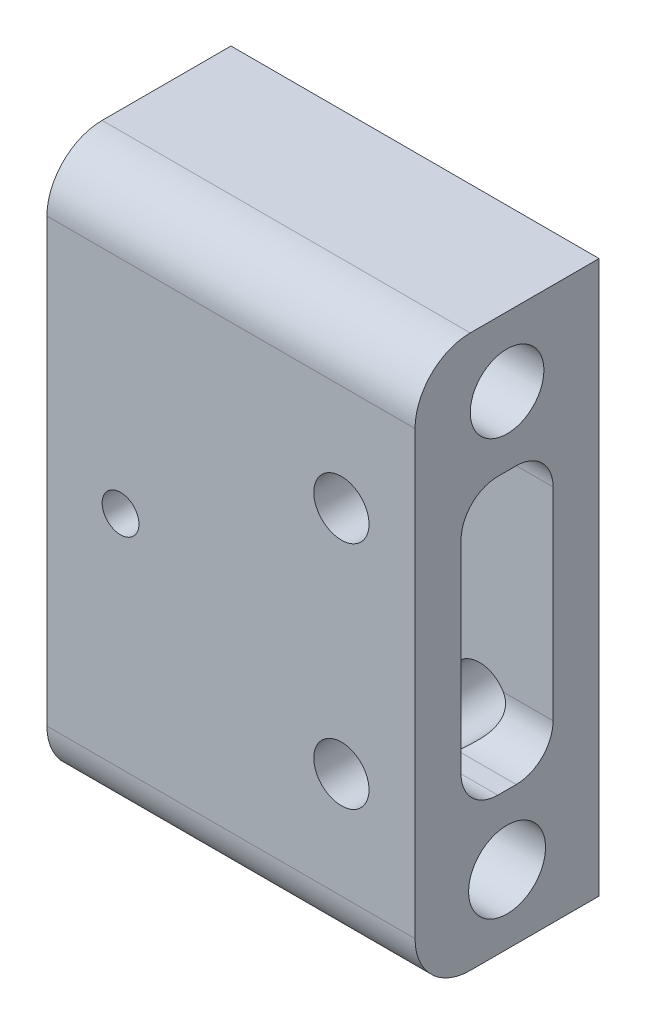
from build123d import *

# Parameters (mm, degrees)
CROQUIS1_W              = 40
CROQUIS1_H              = 60
SALIENTE_EXTRUIR1_DEPTH = 20
CROQUIS2_R              = 4
CROQUIS2_R_2            = 4.178876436
CROQUIS2_W              = 10
CROQUIS2_H              = 30
CORTAR_EXTRUIR1_DEPTH   = 75.833147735
REDONDEO1_R             = 4
CROQUIS3_R              = 2
CROQUIS3_R_2            = 3
CORTAR_EXTRUIR2_DEPTH   = 75.833147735
REDONDEO2_R             = 6


with BuildPart() as part:
    # Croquis1 → Saliente-Extruir1 (new body)
    with BuildSketch(Plane.XY):
        with Locations((20, 30)):
            Rectangle(CROQUIS1_W, CROQUIS1_H)
    extrude(amount=SALIENTE_EXTRUIR1_DEPTH)

    # Croquis2 → Cortar-Extruir1 (cut, through all)
    with BuildSketch(Plane.ZY):
        with Locations((10, 52.5)):
            Circle(CROQUIS2_R)
        with Locations((10, 7.5)):
            Circle(CROQUIS2_R_2)
        with Locations((10, 30)):
            Rectangle(CROQUIS2_W, CROQUIS2_H)
    extrude(amount=-CORTAR_EXTRUIR1_DEPTH, mode=Mode.SUBTRACT)

    # Redondeo1
    redondeo1_edges = [part.edges().sort_by_distance(p)[0] for p in [
        (20, 15, 5),
        (20, 45, 5),
        (20, 45, 15),
        (20, 15, 15),
    ]]
    fillet(redondeo1_edges, radius=REDONDEO1_R)

    # Croquis3 → Cortar-Extruir2 (cut, through all)
    with BuildSketch(Plane.XY.offset(20)):
        with Locations((8, 30)):
            Circle(CROQUIS3_R)
        with Locations((32, 42.5)):
            Circle(CROQUIS3_R_2)
        with Locations((32, 17.5)):
            Circle(CROQUIS3_R_2)
    extrude(amount=-CORTAR_EXTRUIR2_DEPTH, mode=Mode.SUBTRACT)

    # Redondeo2
    redondeo2_edges = [part.edges().sort_by_distance(p)[0] for p in [
        (20, 60, 20),
        (20, 0, 20),
    ]]
    fillet(redondeo2_edges, radius=REDONDEO2_R)


solid = part.part
